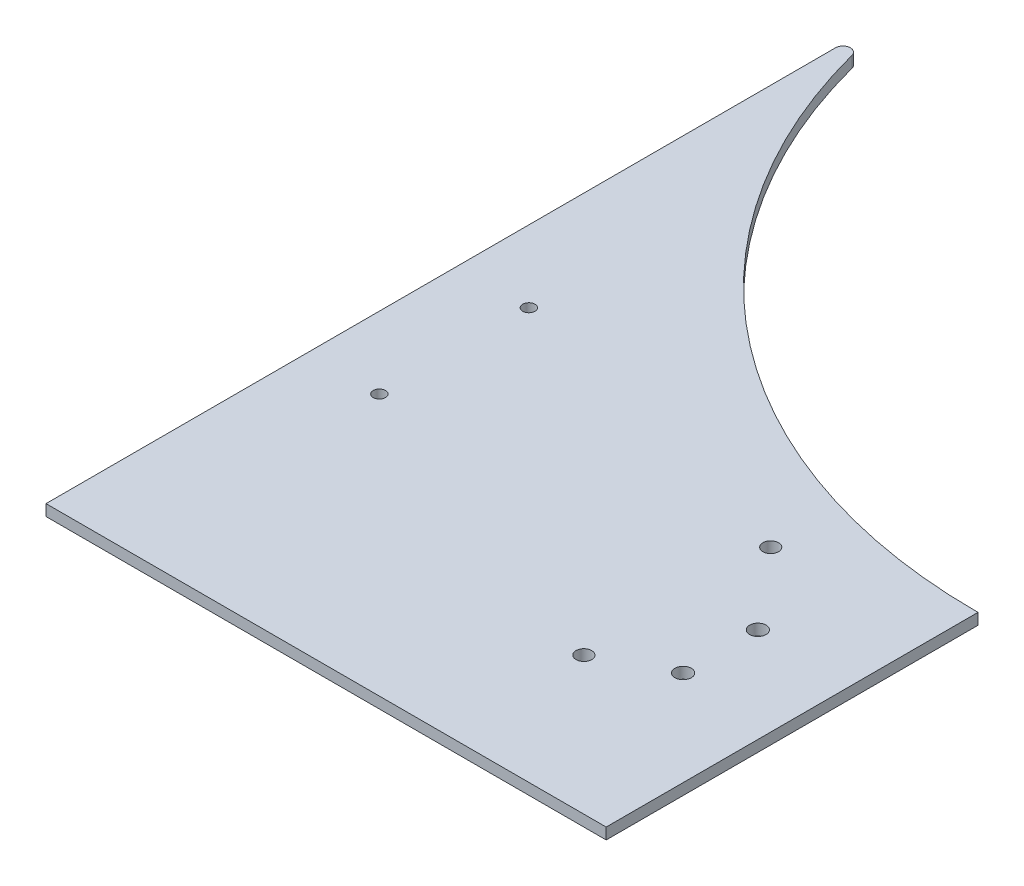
ISO-10303-21;
HEADER;
FILE_DESCRIPTION(('STEP AP214'),'2;1');
FILE_NAME('part.step','',(''),(''),'','','');
FILE_SCHEMA(('AUTOMOTIVE_DESIGN { 1 0 10303 214 1 1 1 1 }'));
ENDSEC;
DATA;
#1=APPLICATION_CONTEXT('core data for automotive mechanical design processes');
#2=APPLICATION_PROTOCOL_DEFINITION('international standard','automotive_design',2000,#1);
#3=PRODUCT_CONTEXT('',#1,'mechanical');
#4=PRODUCT('Part','Part','',(#3));
#5=PRODUCT_RELATED_PRODUCT_CATEGORY('part','',(#4));
#6=PRODUCT_DEFINITION_FORMATION('','',#4);
#7=PRODUCT_DEFINITION_CONTEXT('part definition',#1,'design');
#8=PRODUCT_DEFINITION('design','',#6,#7);
#9=PRODUCT_DEFINITION_SHAPE('','',#8);
#10=(LENGTH_UNIT() NAMED_UNIT(*) SI_UNIT(.MILLI.,.METRE.));
#11=(NAMED_UNIT(*) PLANE_ANGLE_UNIT() SI_UNIT($,.RADIAN.));
#12=(NAMED_UNIT(*) SI_UNIT($,.STERADIAN.) SOLID_ANGLE_UNIT());
#13=UNCERTAINTY_MEASURE_WITH_UNIT(LENGTH_MEASURE(1.E-05),#10,'distance_accuracy_value','');
#14=(GEOMETRIC_REPRESENTATION_CONTEXT(3) GLOBAL_UNCERTAINTY_ASSIGNED_CONTEXT((#13)) GLOBAL_UNIT_ASSIGNED_CONTEXT((#10,
#11,#12)) REPRESENTATION_CONTEXT('',''));
#15=CARTESIAN_POINT('',(0.,0.,0.));
#16=DIRECTION('',(0.,0.,1.));
#17=DIRECTION('',(1.,0.,0.));
#18=AXIS2_PLACEMENT_3D('',#15,#16,#17);
#19=CARTESIAN_POINT('',(0.,0.,0.));
#20=DIRECTION('',(0.,1.,0.));
#21=DIRECTION('',(1.,0.,0.));
#22=AXIS2_PLACEMENT_3D('',#19,#20,#21);
#23=PLANE('',#22);
#24=CARTESIAN_POINT('',(-42.4264068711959,0.,213.137084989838));
#25=DIRECTION('',(0.,1.,0.));
#26=DIRECTION('',(0.,0.,1.));
#27=AXIS2_PLACEMENT_3D('',#24,#25,#26);
#28=CIRCLE('',#27,2.1);
#29=CARTESIAN_POINT('',(-42.4264068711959,0.,215.237084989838));
#30=VERTEX_POINT('',#29);
#31=EDGE_CURVE('E156',#30,#30,#28,.T.);
#32=ORIENTED_EDGE('',*,*,#31,.T.);
#33=EDGE_LOOP('',(#32));
#34=FACE_BOUND('',#33,.T.);
#35=CARTESIAN_POINT('',(-25.,0.,184.));
#36=DIRECTION('',(0.,1.,0.));
#37=DIRECTION('',(0.,0.,1.));
#38=AXIS2_PLACEMENT_3D('',#35,#36,#37);
#39=CIRCLE('',#38,2.2);
#40=CARTESIAN_POINT('',(-25.,0.,186.2));
#41=VERTEX_POINT('',#40);
#42=EDGE_CURVE('E148',#41,#41,#39,.T.);
#43=ORIENTED_EDGE('',*,*,#42,.T.);
#44=EDGE_LOOP('',(#43));
#45=FACE_BOUND('',#44,.T.);
#46=CARTESIAN_POINT('',(-25.,0.,204.));
#47=DIRECTION('',(0.,1.,0.));
#48=DIRECTION('',(0.,0.,1.));
#49=AXIS2_PLACEMENT_3D('',#46,#47,#48);
#50=CIRCLE('',#49,2.2);
#51=CARTESIAN_POINT('',(-25.,0.,206.2));
#52=VERTEX_POINT('',#51);
#53=EDGE_CURVE('E138',#52,#52,#50,.T.);
#54=ORIENTED_EDGE('',*,*,#53,.T.);
#55=EDGE_LOOP('',(#54));
#56=FACE_BOUND('',#55,.T.);
#57=CARTESIAN_POINT('',(-42.4264068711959,0.,163.137084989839));
#58=DIRECTION('',(0.,1.,0.));
#59=DIRECTION('',(0.,0.,1.));
#60=AXIS2_PLACEMENT_3D('',#57,#58,#59);
#61=CIRCLE('',#60,2.1);
#62=CARTESIAN_POINT('',(-42.4264068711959,0.,165.237084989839));
#63=VERTEX_POINT('',#62);
#64=EDGE_CURVE('E126',#63,#63,#61,.T.);
#65=ORIENTED_EDGE('',*,*,#64,.T.);
#66=EDGE_LOOP('',(#65));
#67=FACE_BOUND('',#66,.T.);
#68=CARTESIAN_POINT('',(-130.286223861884,0.,140.00000000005));
#69=DIRECTION('',(0.,1.,0.));
#70=DIRECTION('',(0.,0.,1.));
#71=AXIS2_PLACEMENT_3D('',#68,#69,#70);
#72=CIRCLE('',#71,1.6499999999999);
#73=CARTESIAN_POINT('',(-130.286223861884,0.,141.65000000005));
#74=VERTEX_POINT('',#73);
#75=EDGE_CURVE('E125',#74,#74,#72,.T.);
#76=ORIENTED_EDGE('',*,*,#75,.T.);
#77=EDGE_LOOP('',(#76));
#78=FACE_BOUND('',#77,.T.);
#79=CARTESIAN_POINT('',(-130.286223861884,0.,180.000000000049));
#80=DIRECTION('',(0.,1.,0.));
#81=DIRECTION('',(0.,0.,1.));
#82=AXIS2_PLACEMENT_3D('',#79,#80,#81);
#83=CIRCLE('',#82,1.64999999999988);
#84=CARTESIAN_POINT('',(-130.286223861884,0.,181.650000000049));
#85=VERTEX_POINT('',#84);
#86=EDGE_CURVE('E115',#85,#85,#83,.T.);
#87=ORIENTED_EDGE('',*,*,#86,.T.);
#88=EDGE_LOOP('',(#87));
#89=FACE_BOUND('',#88,.T.);
#90=DIRECTION('',(0.,0.,1.));
#91=VECTOR('',#90,1.);
#92=CARTESIAN_POINT('',(-149.5,0.,0.));
#93=LINE('',#92,#91);
#94=CARTESIAN_POINT('',(-149.5,0.,38.7298334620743));
#95=VERTEX_POINT('',#94);
#96=CARTESIAN_POINT('',(-149.5,0.,250.));
#97=VERTEX_POINT('',#96);
#98=EDGE_CURVE('E78',#95,#97,#93,.T.);
#99=ORIENTED_EDGE('',*,*,#98,.F.);
#100=CARTESIAN_POINT('',(-147.5,0.,38.7298334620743));
#101=DIRECTION('',(0.,-1.,0.));
#102=DIRECTION('',(0.,0.,1.));
#103=AXIS2_PLACEMENT_3D('',#100,#101,#102);
#104=CIRCLE('',#103,2.);
#105=CARTESIAN_POINT('',(-145.565573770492,0.,38.2219012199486));
#106=VERTEX_POINT('',#105);
#107=EDGE_CURVE('E81',#95,#106,#104,.T.);
#108=ORIENTED_EDGE('',*,*,#107,.T.);
#109=CARTESIAN_POINT('',(0.,0.,0.));
#110=DIRECTION('',(0.,1.,0.));
#111=DIRECTION('',(0.,0.,1.));
#112=AXIS2_PLACEMENT_3D('',#109,#110,#111);
#113=CIRCLE('',#112,150.5);
#114=CARTESIAN_POINT('',(0.409090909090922,0.,150.49944400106));
#115=VERTEX_POINT('',#114);
#116=EDGE_CURVE('E166',#106,#115,#113,.T.);
#117=ORIENTED_EDGE('',*,*,#116,.T.);
#118=DIRECTION('',(0.,0.,1.));
#119=VECTOR('',#118,1.);
#120=CARTESIAN_POINT('',(0.409090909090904,0.,0.));
#121=LINE('',#120,#119);
#122=CARTESIAN_POINT('',(0.409090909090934,0.,250.));
#123=VERTEX_POINT('',#122);
#124=EDGE_CURVE('E25',#115,#123,#121,.T.);
#125=ORIENTED_EDGE('',*,*,#124,.T.);
#126=DIRECTION('',(-1.,0.,0.));
#127=VECTOR('',#126,1.);
#128=CARTESIAN_POINT('',(0.,0.,250.));
#129=LINE('',#128,#127);
#130=EDGE_CURVE('E84',#123,#97,#129,.T.);
#131=ORIENTED_EDGE('',*,*,#130,.T.);
#132=EDGE_LOOP('',(#99,#108,#117,#125,#131));
#133=FACE_BOUND('',#132,.T.);
#134=ADVANCED_FACE('F17',(#34,#45,#56,#67,#78,#89,#133),#23,.F.);
#135=CARTESIAN_POINT('',(0.,3.,0.));
#136=DIRECTION('',(0.,1.,0.));
#137=DIRECTION('',(1.,0.,0.));
#138=AXIS2_PLACEMENT_3D('',#135,#136,#137);
#139=PLANE('',#138);
#140=CARTESIAN_POINT('',(-42.4264068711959,3.,213.137084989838));
#141=DIRECTION('',(0.,1.,0.));
#142=DIRECTION('',(0.,0.,1.));
#143=AXIS2_PLACEMENT_3D('',#140,#141,#142);
#144=CIRCLE('',#143,2.1);
#145=CARTESIAN_POINT('',(-42.4264068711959,3.,215.237084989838));
#146=VERTEX_POINT('',#145);
#147=EDGE_CURVE('E111',#146,#146,#144,.T.);
#148=ORIENTED_EDGE('',*,*,#147,.F.);
#149=EDGE_LOOP('',(#148));
#150=FACE_BOUND('',#149,.T.);
#151=CARTESIAN_POINT('',(-25.,3.,184.));
#152=DIRECTION('',(0.,1.,0.));
#153=DIRECTION('',(0.,0.,1.));
#154=AXIS2_PLACEMENT_3D('',#151,#152,#153);
#155=CIRCLE('',#154,2.2);
#156=CARTESIAN_POINT('',(-25.,3.,186.2));
#157=VERTEX_POINT('',#156);
#158=EDGE_CURVE('E152',#157,#157,#155,.T.);
#159=ORIENTED_EDGE('',*,*,#158,.F.);
#160=EDGE_LOOP('',(#159));
#161=FACE_BOUND('',#160,.T.);
#162=CARTESIAN_POINT('',(-25.,3.,204.));
#163=DIRECTION('',(0.,1.,0.));
#164=DIRECTION('',(0.,0.,1.));
#165=AXIS2_PLACEMENT_3D('',#162,#163,#164);
#166=CIRCLE('',#165,2.2);
#167=CARTESIAN_POINT('',(-25.,3.,206.2));
#168=VERTEX_POINT('',#167);
#169=EDGE_CURVE('E141',#168,#168,#166,.T.);
#170=ORIENTED_EDGE('',*,*,#169,.F.);
#171=EDGE_LOOP('',(#170));
#172=FACE_BOUND('',#171,.T.);
#173=CARTESIAN_POINT('',(-42.4264068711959,3.,163.137084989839));
#174=DIRECTION('',(0.,1.,0.));
#175=DIRECTION('',(0.,0.,1.));
#176=AXIS2_PLACEMENT_3D('',#173,#174,#175);
#177=CIRCLE('',#176,2.1);
#178=CARTESIAN_POINT('',(-42.4264068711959,3.,165.237084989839));
#179=VERTEX_POINT('',#178);
#180=EDGE_CURVE('E130',#179,#179,#177,.T.);
#181=ORIENTED_EDGE('',*,*,#180,.F.);
#182=EDGE_LOOP('',(#181));
#183=FACE_BOUND('',#182,.T.);
#184=CARTESIAN_POINT('',(-130.286223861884,3.,140.00000000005));
#185=DIRECTION('',(0.,1.,0.));
#186=DIRECTION('',(0.,0.,1.));
#187=AXIS2_PLACEMENT_3D('',#184,#185,#186);
#188=CIRCLE('',#187,1.6499999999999);
#189=CARTESIAN_POINT('',(-130.286223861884,3.,141.65000000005));
#190=VERTEX_POINT('',#189);
#191=EDGE_CURVE('E131',#190,#190,#188,.T.);
#192=ORIENTED_EDGE('',*,*,#191,.F.);
#193=EDGE_LOOP('',(#192));
#194=FACE_BOUND('',#193,.T.);
#195=CARTESIAN_POINT('',(-130.286223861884,3.,180.000000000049));
#196=DIRECTION('',(0.,1.,0.));
#197=DIRECTION('',(0.,0.,1.));
#198=AXIS2_PLACEMENT_3D('',#195,#196,#197);
#199=CIRCLE('',#198,1.64999999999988);
#200=CARTESIAN_POINT('',(-130.286223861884,3.,181.650000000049));
#201=VERTEX_POINT('',#200);
#202=EDGE_CURVE('E121',#201,#201,#199,.T.);
#203=ORIENTED_EDGE('',*,*,#202,.F.);
#204=EDGE_LOOP('',(#203));
#205=FACE_BOUND('',#204,.T.);
#206=CARTESIAN_POINT('',(0.,3.,0.));
#207=DIRECTION('',(0.,1.,0.));
#208=DIRECTION('',(0.,0.,1.));
#209=AXIS2_PLACEMENT_3D('',#206,#207,#208);
#210=CIRCLE('',#209,150.5);
#211=CARTESIAN_POINT('',(-145.565573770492,3.,38.2219012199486));
#212=VERTEX_POINT('',#211);
#213=CARTESIAN_POINT('',(0.409090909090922,3.,150.49944400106));
#214=VERTEX_POINT('',#213);
#215=EDGE_CURVE('E168',#212,#214,#210,.T.);
#216=ORIENTED_EDGE('',*,*,#215,.F.);
#217=CARTESIAN_POINT('',(-147.5,3.,38.7298334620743));
#218=DIRECTION('',(0.,1.,0.));
#219=DIRECTION('',(0.,0.,1.));
#220=AXIS2_PLACEMENT_3D('',#217,#218,#219);
#221=CIRCLE('',#220,2.);
#222=CARTESIAN_POINT('',(-149.5,3.,38.7298334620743));
#223=VERTEX_POINT('',#222);
#224=EDGE_CURVE('E105',#212,#223,#221,.T.);
#225=ORIENTED_EDGE('',*,*,#224,.T.);
#226=DIRECTION('',(0.,0.,1.));
#227=VECTOR('',#226,1.);
#228=CARTESIAN_POINT('',(-149.5,3.,0.));
#229=LINE('',#228,#227);
#230=CARTESIAN_POINT('',(-149.5,3.,250.));
#231=VERTEX_POINT('',#230);
#232=EDGE_CURVE('E90',#223,#231,#229,.T.);
#233=ORIENTED_EDGE('',*,*,#232,.T.);
#234=DIRECTION('',(-1.,0.,0.));
#235=VECTOR('',#234,1.);
#236=CARTESIAN_POINT('',(0.,3.,250.));
#237=LINE('',#236,#235);
#238=CARTESIAN_POINT('',(0.409090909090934,3.,250.));
#239=VERTEX_POINT('',#238);
#240=EDGE_CURVE('E120',#239,#231,#237,.T.);
#241=ORIENTED_EDGE('',*,*,#240,.F.);
#242=DIRECTION('',(0.,0.,1.));
#243=VECTOR('',#242,1.);
#244=CARTESIAN_POINT('',(0.409090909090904,3.,0.));
#245=LINE('',#244,#243);
#246=EDGE_CURVE('E11',#214,#239,#245,.T.);
#247=ORIENTED_EDGE('',*,*,#246,.F.);
#248=EDGE_LOOP('',(#216,#225,#233,#241,#247));
#249=FACE_BOUND('',#248,.T.);
#250=ADVANCED_FACE('F383',(#150,#161,#172,#183,#194,#205,#249),#139,.T.);
#251=CARTESIAN_POINT('',(0.409090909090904,3.,0.));
#252=DIRECTION('',(1.,0.,0.));
#253=DIRECTION('',(0.,0.,-1.));
#254=AXIS2_PLACEMENT_3D('',#251,#252,#253);
#255=PLANE('',#254);
#256=ORIENTED_EDGE('',*,*,#124,.F.);
#257=DIRECTION('',(0.,-1.,0.));
#258=VECTOR('',#257,1.);
#259=CARTESIAN_POINT('',(0.409090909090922,3.,150.49944400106));
#260=LINE('',#259,#258);
#261=EDGE_CURVE('E159',#214,#115,#260,.T.);
#262=ORIENTED_EDGE('',*,*,#261,.F.);
#263=ORIENTED_EDGE('',*,*,#246,.T.);
#264=DIRECTION('',(0.,-1.,0.));
#265=VECTOR('',#264,1.);
#266=CARTESIAN_POINT('',(0.409090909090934,3.,250.));
#267=LINE('',#266,#265);
#268=EDGE_CURVE('E117',#239,#123,#267,.T.);
#269=ORIENTED_EDGE('',*,*,#268,.T.);
#270=EDGE_LOOP('',(#256,#262,#263,#269));
#271=FACE_BOUND('',#270,.T.);
#272=ADVANCED_FACE('F387',(#271),#255,.T.);
#273=CARTESIAN_POINT('',(0.,3.,250.));
#274=DIRECTION('',(0.,0.,1.));
#275=DIRECTION('',(1.,0.,0.));
#276=AXIS2_PLACEMENT_3D('',#273,#274,#275);
#277=PLANE('',#276);
#278=ORIENTED_EDGE('',*,*,#130,.F.);
#279=ORIENTED_EDGE('',*,*,#268,.F.);
#280=ORIENTED_EDGE('',*,*,#240,.T.);
#281=DIRECTION('',(0.,-1.,0.));
#282=VECTOR('',#281,1.);
#283=CARTESIAN_POINT('',(-149.5,3.,250.));
#284=LINE('',#283,#282);
#285=EDGE_CURVE('E89',#231,#97,#284,.T.);
#286=ORIENTED_EDGE('',*,*,#285,.T.);
#287=EDGE_LOOP('',(#278,#279,#280,#286));
#288=FACE_BOUND('',#287,.T.);
#289=ADVANCED_FACE('F360',(#288),#277,.T.);
#290=CARTESIAN_POINT('',(-149.5,3.,0.));
#291=DIRECTION('',(1.,0.,0.));
#292=DIRECTION('',(0.,0.,-1.));
#293=AXIS2_PLACEMENT_3D('',#290,#291,#292);
#294=PLANE('',#293);
#295=ORIENTED_EDGE('',*,*,#232,.F.);
#296=DIRECTION('',(0.,-1.,0.));
#297=VECTOR('',#296,1.);
#298=CARTESIAN_POINT('',(-149.5,3.,38.7298334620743));
#299=LINE('',#298,#297);
#300=EDGE_CURVE('E93',#223,#95,#299,.T.);
#301=ORIENTED_EDGE('',*,*,#300,.T.);
#302=ORIENTED_EDGE('',*,*,#98,.T.);
#303=ORIENTED_EDGE('',*,*,#285,.F.);
#304=EDGE_LOOP('',(#295,#301,#302,#303));
#305=FACE_BOUND('',#304,.T.);
#306=ADVANCED_FACE('F94',(#305),#294,.F.);
#307=CARTESIAN_POINT('',(0.,3.,0.));
#308=DIRECTION('',(0.,-1.,0.));
#309=DIRECTION('',(0.,0.,-1.));
#310=AXIS2_PLACEMENT_3D('',#307,#308,#309);
#311=CYLINDRICAL_SURFACE('',#310,150.5);
#312=ORIENTED_EDGE('',*,*,#116,.F.);
#313=DIRECTION('',(0.,1.,0.));
#314=VECTOR('',#313,1.);
#315=CARTESIAN_POINT('',(-145.565573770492,3.,38.2219012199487));
#316=LINE('',#315,#314);
#317=EDGE_CURVE('E99',#106,#212,#316,.T.);
#318=ORIENTED_EDGE('',*,*,#317,.T.);
#319=ORIENTED_EDGE('',*,*,#215,.T.);
#320=ORIENTED_EDGE('',*,*,#261,.T.);
#321=EDGE_LOOP('',(#312,#318,#319,#320));
#322=FACE_BOUND('',#321,.T.);
#323=ADVANCED_FACE('F359',(#322),#311,.F.);
#324=CARTESIAN_POINT('',(-147.5,3.,38.7298334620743));
#325=DIRECTION('',(0.,-1.,0.));
#326=DIRECTION('',(0.,0.,-1.));
#327=AXIS2_PLACEMENT_3D('',#324,#325,#326);
#328=CYLINDRICAL_SURFACE('',#327,2.);
#329=ORIENTED_EDGE('',*,*,#224,.F.);
#330=ORIENTED_EDGE('',*,*,#317,.F.);
#331=ORIENTED_EDGE('',*,*,#107,.F.);
#332=ORIENTED_EDGE('',*,*,#300,.F.);
#333=EDGE_LOOP('',(#329,#330,#331,#332));
#334=FACE_BOUND('',#333,.T.);
#335=ADVANCED_FACE('F102',(#334),#328,.T.);
#336=CARTESIAN_POINT('',(-42.4264068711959,-7.,213.137084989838));
#337=DIRECTION('',(0.,1.,0.));
#338=DIRECTION('',(0.,0.,1.));
#339=AXIS2_PLACEMENT_3D('',#336,#337,#338);
#340=CYLINDRICAL_SURFACE('',#339,2.1);
#341=ORIENTED_EDGE('',*,*,#147,.T.);
#342=EDGE_LOOP('',(#341));
#343=FACE_BOUND('',#342,.T.);
#344=ORIENTED_EDGE('',*,*,#31,.F.);
#345=EDGE_LOOP('',(#344));
#346=FACE_BOUND('',#345,.T.);
#347=ADVANCED_FACE('F398',(#343,#346),#340,.F.);
#348=CARTESIAN_POINT('',(-25.,-7.,184.));
#349=DIRECTION('',(0.,1.,0.));
#350=DIRECTION('',(0.,0.,1.));
#351=AXIS2_PLACEMENT_3D('',#348,#349,#350);
#352=CYLINDRICAL_SURFACE('',#351,2.2);
#353=ORIENTED_EDGE('',*,*,#158,.T.);
#354=EDGE_LOOP('',(#353));
#355=FACE_BOUND('',#354,.T.);
#356=ORIENTED_EDGE('',*,*,#42,.F.);
#357=EDGE_LOOP('',(#356));
#358=FACE_BOUND('',#357,.T.);
#359=ADVANCED_FACE('F393',(#355,#358),#352,.F.);
#360=CARTESIAN_POINT('',(-25.,-7.,204.));
#361=DIRECTION('',(0.,1.,0.));
#362=DIRECTION('',(0.,0.,1.));
#363=AXIS2_PLACEMENT_3D('',#360,#361,#362);
#364=CYLINDRICAL_SURFACE('',#363,2.2);
#365=ORIENTED_EDGE('',*,*,#169,.T.);
#366=EDGE_LOOP('',(#365));
#367=FACE_BOUND('',#366,.T.);
#368=ORIENTED_EDGE('',*,*,#53,.F.);
#369=EDGE_LOOP('',(#368));
#370=FACE_BOUND('',#369,.T.);
#371=ADVANCED_FACE('F397',(#367,#370),#364,.F.);
#372=CARTESIAN_POINT('',(-42.4264068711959,-7.,163.137084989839));
#373=DIRECTION('',(0.,1.,0.));
#374=DIRECTION('',(0.,0.,1.));
#375=AXIS2_PLACEMENT_3D('',#372,#373,#374);
#376=CYLINDRICAL_SURFACE('',#375,2.1);
#377=ORIENTED_EDGE('',*,*,#180,.T.);
#378=EDGE_LOOP('',(#377));
#379=FACE_BOUND('',#378,.T.);
#380=ORIENTED_EDGE('',*,*,#64,.F.);
#381=EDGE_LOOP('',(#380));
#382=FACE_BOUND('',#381,.T.);
#383=ADVANCED_FACE('F377',(#379,#382),#376,.F.);
#384=CARTESIAN_POINT('',(-130.286223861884,-7.,140.00000000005));
#385=DIRECTION('',(0.,1.,0.));
#386=DIRECTION('',(0.,0.,1.));
#387=AXIS2_PLACEMENT_3D('',#384,#385,#386);
#388=CYLINDRICAL_SURFACE('',#387,1.6499999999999);
#389=ORIENTED_EDGE('',*,*,#191,.T.);
#390=EDGE_LOOP('',(#389));
#391=FACE_BOUND('',#390,.T.);
#392=ORIENTED_EDGE('',*,*,#75,.F.);
#393=EDGE_LOOP('',(#392));
#394=FACE_BOUND('',#393,.T.);
#395=ADVANCED_FACE('F369',(#391,#394),#388,.F.);
#396=CARTESIAN_POINT('',(-130.286223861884,-7.,180.000000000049));
#397=DIRECTION('',(0.,1.,0.));
#398=DIRECTION('',(0.,0.,1.));
#399=AXIS2_PLACEMENT_3D('',#396,#397,#398);
#400=CYLINDRICAL_SURFACE('',#399,1.64999999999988);
#401=ORIENTED_EDGE('',*,*,#202,.T.);
#402=EDGE_LOOP('',(#401));
#403=FACE_BOUND('',#402,.T.);
#404=ORIENTED_EDGE('',*,*,#86,.F.);
#405=EDGE_LOOP('',(#404));
#406=FACE_BOUND('',#405,.T.);
#407=ADVANCED_FACE('F365',(#403,#406),#400,.F.);
#408=CLOSED_SHELL('',(#134,#250,#272,#289,#306,#323,#335,#347,#359,#371,#383,#395,#407));
#409=MANIFOLD_SOLID_BREP('B1',#408);
#410=ADVANCED_BREP_SHAPE_REPRESENTATION('',(#18,#409),#14);
#411=SHAPE_DEFINITION_REPRESENTATION(#9,#410);
ENDSEC;
END-ISO-10303-21;
